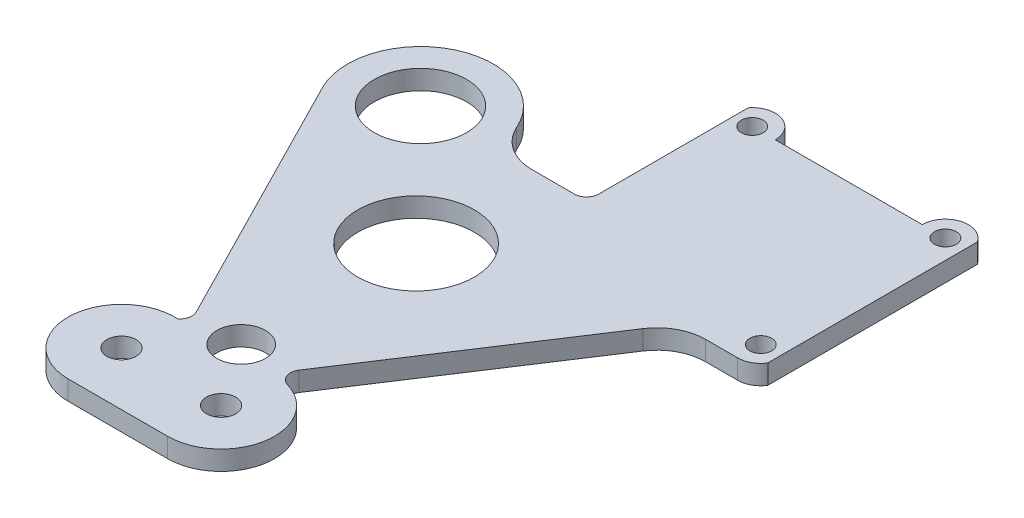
from build123d import *

# Parameters (mm, degrees)
ESQUISSE1_R      = 24
ESQUISSE1_R_2    = 19
ESQUISSE1_R_3    = 10
ESQUISSE1_R_4    = 6
ESQUISSE1_R_5    = 4.5
EXTRUSION1_DEPTH = 8


with BuildPart() as part:
    # Esquisse1 → Extrusion1 (new body)
    with BuildSketch(Plane(origin=(0, 0, 0), x_dir=(1, 0, 0), z_dir=(0, 1, 0))):
        with BuildLine():
            Line((-20.795311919, -69.72937143), (-74.828128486, 36.276228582))
            ThreePointArc((-74.828128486, 36.276228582), (-61.002236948, 76.983801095), (-20.68, 62.071425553))
            ThreePointArc((-20.68, 62.071425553), (-13.302163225, 53.418394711), (-2.4, 50.185709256))
            Line((-2.4, 50.185709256), (15, 50.185709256))
            ThreePointArc((15, 50.185709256), (18.535533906, 51.65017535), (20, 55.185709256))
            Line((20, 55.185709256), (20, 116.730951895))
            ThreePointArc((20, 116.730951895), (30.582207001, 119.886100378), (37, 110.9))
            Line((37, 110.9), (97.5, 110.9))
            ThreePointArc((97.5, 110.9), (104.330730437, 120.017291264), (115, 116.023475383))
            Line((115, 116.023475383), (115, 29.776524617))
            ThreePointArc((115, 29.776524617), (111.55943987, 26.565642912), (107, 25.4))
            Line((107, 25.4), (93.803118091, 25.4))
            ThreePointArc((93.803118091, 25.4), (84.289035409, 22.992107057), (77.065841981, 16.348223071))
            Line((77.065841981, 16.348223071), (21.065680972, -69.262944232))
            ThreePointArc((21.065680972, -69.262944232), (20.557524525, -73.726462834), (23.837363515, -76.796296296))
            ThreePointArc((23.837363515, -76.796296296), (39.396536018, -101.039945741), (17.621762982, -119.9))
            Line((17.621762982, -119.9), (-23.378237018, -119.9))
            ThreePointArc((-23.378237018, -119.9), (-45.369843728, -97.292353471), (-22.16340761, -75.933566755))
            ThreePointArc((-22.16340761, -75.933566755), (-20.367302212, -73.076690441), (-20.795311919, -69.72937143))
        make_face()
        with Locations(Location((0, 0, 0), (0, 0, 270))):
            Circle(ESQUISSE1_R, mode=Mode.SUBTRACT)
        with Locations(Location((-48.1, 49.9, 0), (0, 0, 270))):
            Circle(ESQUISSE1_R_2, mode=Mode.SUBTRACT)
        with Locations(Location((0, -72, 0), (0, 0, 270))):
            Circle(ESQUISSE1_R_3, mode=Mode.SUBTRACT)
        with Locations(Location((-23.378237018, -97.9, 0), (0, 0, 270))):
            Circle(ESQUISSE1_R_4, mode=Mode.SUBTRACT)
        with Locations(Location((17.621762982, -97.9, 0), (0, 0, 270))):
            Circle(ESQUISSE1_R_4, mode=Mode.SUBTRACT)
        with Locations(Location((107, 110.9, 0), (0, 0, 270))):
            Circle(ESQUISSE1_R_5, mode=Mode.SUBTRACT)
        with Locations(Location((107, 34.9, 0), (0, 0, 270))):
            Circle(ESQUISSE1_R_5, mode=Mode.SUBTRACT)
        with Locations(Location((27.5, 110.9, 0), (0, 0, 270))):
            Circle(ESQUISSE1_R_5, mode=Mode.SUBTRACT)
    extrude(amount=EXTRUSION1_DEPTH)


solid = part.part
